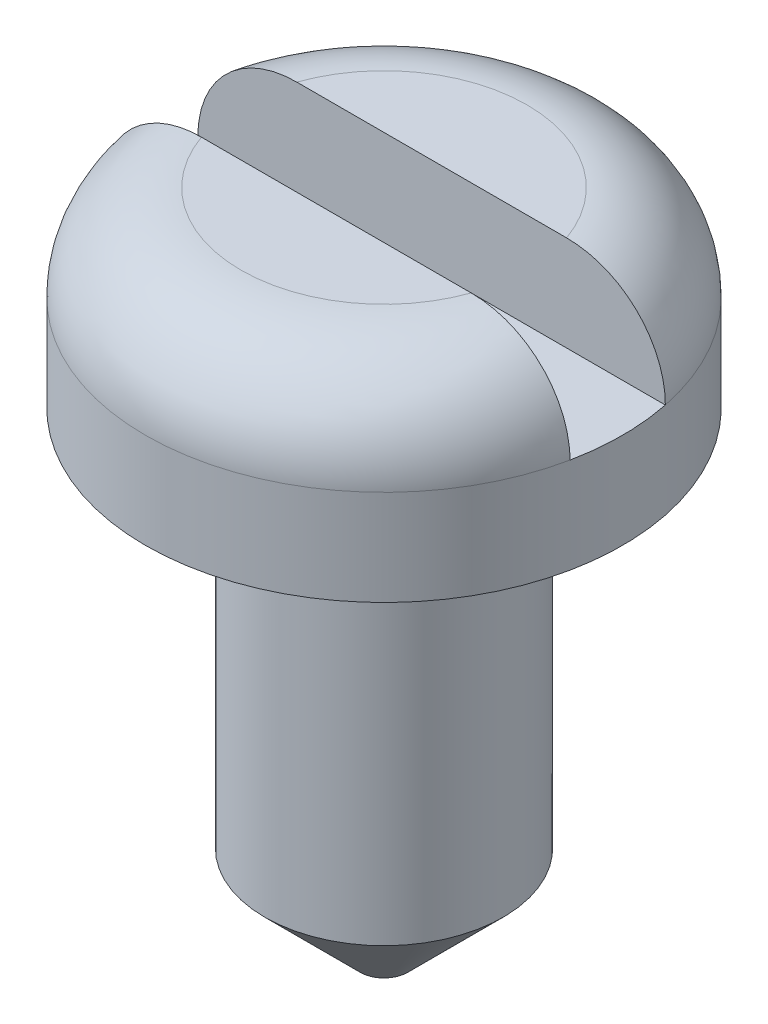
ISO-10303-21;
HEADER;
FILE_DESCRIPTION(('STEP AP214'),'2;1');
FILE_NAME('part.step','',(''),(''),'','','');
FILE_SCHEMA(('AUTOMOTIVE_DESIGN { 1 0 10303 214 1 1 1 1 }'));
ENDSEC;
DATA;
#1=APPLICATION_CONTEXT('core data for automotive mechanical design processes');
#2=APPLICATION_PROTOCOL_DEFINITION('international standard','automotive_design',2000,#1);
#3=PRODUCT_CONTEXT('',#1,'mechanical');
#4=PRODUCT('Part','Part','',(#3));
#5=PRODUCT_RELATED_PRODUCT_CATEGORY('part','',(#4));
#6=PRODUCT_DEFINITION_FORMATION('','',#4);
#7=PRODUCT_DEFINITION_CONTEXT('part definition',#1,'design');
#8=PRODUCT_DEFINITION('design','',#6,#7);
#9=PRODUCT_DEFINITION_SHAPE('','',#8);
#10=(LENGTH_UNIT() NAMED_UNIT(*) SI_UNIT(.MILLI.,.METRE.));
#11=(NAMED_UNIT(*) PLANE_ANGLE_UNIT() SI_UNIT($,.RADIAN.));
#12=(NAMED_UNIT(*) SI_UNIT($,.STERADIAN.) SOLID_ANGLE_UNIT());
#13=UNCERTAINTY_MEASURE_WITH_UNIT(LENGTH_MEASURE(1.E-05),#10,'distance_accuracy_value','');
#14=(GEOMETRIC_REPRESENTATION_CONTEXT(3) GLOBAL_UNCERTAINTY_ASSIGNED_CONTEXT((#13)) GLOBAL_UNIT_ASSIGNED_CONTEXT((#10,
#11,#12)) REPRESENTATION_CONTEXT('',''));
#15=CARTESIAN_POINT('',(0.,0.,0.));
#16=DIRECTION('',(0.,0.,1.));
#17=DIRECTION('',(1.,0.,0.));
#18=AXIS2_PLACEMENT_3D('',#15,#16,#17);
#19=CARTESIAN_POINT('',(0.,8.89,0.));
#20=DIRECTION('',(0.,-1.,0.));
#21=DIRECTION('',(0.,0.,-1.));
#22=AXIS2_PLACEMENT_3D('',#19,#20,#21);
#23=CYLINDRICAL_SURFACE('',#22,3.175);
#24=CARTESIAN_POINT('',(0.,6.35,0.));
#25=DIRECTION('',(0.,1.,0.));
#26=DIRECTION('',(0.,0.,1.));
#27=AXIS2_PLACEMENT_3D('',#24,#25,#26);
#28=CIRCLE('',#27,3.175);
#29=CARTESIAN_POINT('',(0.,6.35,3.175));
#30=VERTEX_POINT('',#29);
#31=EDGE_CURVE('E107',#30,#30,#28,.T.);
#32=ORIENTED_EDGE('',*,*,#31,.T.);
#33=EDGE_LOOP('',(#32));
#34=FACE_BOUND('',#33,.T.);
#35=CARTESIAN_POINT('',(0.,7.62,0.));
#36=DIRECTION('',(0.,1.,0.));
#37=DIRECTION('',(0.,0.,1.));
#38=AXIS2_PLACEMENT_3D('',#35,#36,#37);
#39=CIRCLE('',#38,3.175);
#40=CARTESIAN_POINT('',(-3.11085197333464,7.62,-0.635));
#41=VERTEX_POINT('',#40);
#42=CARTESIAN_POINT('',(-3.11085197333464,7.62,0.635));
#43=VERTEX_POINT('',#42);
#44=EDGE_CURVE('E105',#41,#43,#39,.T.);
#45=ORIENTED_EDGE('',*,*,#44,.F.);
#46=CARTESIAN_POINT('',(0.,7.62,0.));
#47=DIRECTION('',(0.,1.,0.));
#48=DIRECTION('',(0.,0.,1.));
#49=AXIS2_PLACEMENT_3D('',#46,#47,#48);
#50=CIRCLE('',#49,3.175);
#51=CARTESIAN_POINT('',(3.11085197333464,7.62,-0.635));
#52=VERTEX_POINT('',#51);
#53=EDGE_CURVE('E113',#41,#52,#50,.F.);
#54=ORIENTED_EDGE('',*,*,#53,.T.);
#55=CARTESIAN_POINT('',(3.11085197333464,7.62,0.635));
#56=VERTEX_POINT('',#55);
#57=EDGE_CURVE('E102',#56,#52,#39,.T.);
#58=ORIENTED_EDGE('',*,*,#57,.F.);
#59=CARTESIAN_POINT('',(0.,7.62,0.));
#60=DIRECTION('',(0.,1.,0.));
#61=DIRECTION('',(0.,0.,1.));
#62=AXIS2_PLACEMENT_3D('',#59,#60,#61);
#63=CIRCLE('',#62,3.175);
#64=EDGE_CURVE('E111',#56,#43,#63,.F.);
#65=ORIENTED_EDGE('',*,*,#64,.T.);
#66=EDGE_LOOP('',(#45,#54,#58,#65));
#67=FACE_BOUND('',#66,.T.);
#68=ADVANCED_FACE('F47',(#34,#67),#23,.T.);
#69=CARTESIAN_POINT('',(0.,8.89,0.));
#70=DIRECTION('',(0.,1.,0.));
#71=DIRECTION('',(0.,0.,1.));
#72=AXIS2_PLACEMENT_3D('',#69,#70,#71);
#73=PLANE('',#72);
#74=DIRECTION('',(1.,0.,0.));
#75=VECTOR('',#74,1.);
#76=CARTESIAN_POINT('',(0.,8.89,-0.635));
#77=LINE('',#76,#75);
#78=CARTESIAN_POINT('',(-1.79605122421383,8.89,-0.635));
#79=VERTEX_POINT('',#78);
#80=CARTESIAN_POINT('',(1.79605122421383,8.89,-0.635));
#81=VERTEX_POINT('',#80);
#82=EDGE_CURVE('E205',#79,#81,#77,.T.);
#83=ORIENTED_EDGE('',*,*,#82,.T.);
#84=CARTESIAN_POINT('',(0.,8.89,0.));
#85=DIRECTION('',(0.,1.,0.));
#86=DIRECTION('',(0.,0.,1.));
#87=AXIS2_PLACEMENT_3D('',#84,#85,#86);
#88=CIRCLE('',#87,1.905);
#89=EDGE_CURVE('E115',#81,#79,#88,.T.);
#90=ORIENTED_EDGE('',*,*,#89,.T.);
#91=EDGE_LOOP('',(#83,#90));
#92=FACE_BOUND('',#91,.T.);
#93=ADVANCED_FACE('F171',(#92),#73,.T.);
#94=DIRECTION('',(-1.,0.,0.));
#95=VECTOR('',#94,1.);
#96=CARTESIAN_POINT('',(0.,8.89,0.635));
#97=LINE('',#96,#95);
#98=CARTESIAN_POINT('',(1.79605122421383,8.89,0.635));
#99=VERTEX_POINT('',#98);
#100=CARTESIAN_POINT('',(-1.79605122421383,8.89,0.635));
#101=VERTEX_POINT('',#100);
#102=EDGE_CURVE('E93',#99,#101,#97,.T.);
#103=ORIENTED_EDGE('',*,*,#102,.T.);
#104=CARTESIAN_POINT('',(0.,8.89,0.));
#105=DIRECTION('',(0.,1.,0.));
#106=DIRECTION('',(0.,0.,1.));
#107=AXIS2_PLACEMENT_3D('',#104,#105,#106);
#108=CIRCLE('',#107,1.905);
#109=EDGE_CURVE('E123',#101,#99,#108,.T.);
#110=ORIENTED_EDGE('',*,*,#109,.T.);
#111=EDGE_LOOP('',(#103,#110));
#112=FACE_BOUND('',#111,.T.);
#113=ADVANCED_FACE('F175',(#112),#73,.T.);
#114=CARTESIAN_POINT('',(0.,6.35,0.));
#115=DIRECTION('',(0.,-1.,0.));
#116=DIRECTION('',(0.,0.,-1.));
#117=AXIS2_PLACEMENT_3D('',#114,#115,#116);
#118=CYLINDRICAL_SURFACE('',#117,1.5875);
#119=CARTESIAN_POINT('',(0.,1.27,0.));
#120=DIRECTION('',(0.,1.,0.));
#121=DIRECTION('',(0.,0.,1.));
#122=AXIS2_PLACEMENT_3D('',#119,#120,#121);
#123=CIRCLE('',#122,1.5875);
#124=CARTESIAN_POINT('',(0.,1.27,1.5875));
#125=VERTEX_POINT('',#124);
#126=EDGE_CURVE('E57',#125,#125,#123,.T.);
#127=ORIENTED_EDGE('',*,*,#126,.T.);
#128=EDGE_LOOP('',(#127));
#129=FACE_BOUND('',#128,.T.);
#130=CARTESIAN_POINT('',(0.,6.35,0.));
#131=DIRECTION('',(0.,1.,0.));
#132=DIRECTION('',(0.,0.,1.));
#133=AXIS2_PLACEMENT_3D('',#130,#131,#132);
#134=CIRCLE('',#133,1.5875);
#135=CARTESIAN_POINT('',(0.,6.35,1.5875));
#136=VERTEX_POINT('',#135);
#137=EDGE_CURVE('E200',#136,#136,#134,.T.);
#138=ORIENTED_EDGE('',*,*,#137,.F.);
#139=EDGE_LOOP('',(#138));
#140=FACE_BOUND('',#139,.T.);
#141=ADVANCED_FACE('F157',(#129,#140),#118,.T.);
#142=CARTESIAN_POINT('',(0.,0.,0.));
#143=DIRECTION('',(0.,1.,0.));
#144=DIRECTION('',(0.,0.,1.));
#145=AXIS2_PLACEMENT_3D('',#142,#143,#144);
#146=PLANE('',#145);
#147=CARTESIAN_POINT('',(0.,0.,0.));
#148=DIRECTION('',(0.,1.,0.));
#149=DIRECTION('',(0.,0.,1.));
#150=AXIS2_PLACEMENT_3D('',#147,#148,#149);
#151=CIRCLE('',#150,0.317499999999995);
#152=CARTESIAN_POINT('',(0.,0.,0.317499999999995));
#153=VERTEX_POINT('',#152);
#154=EDGE_CURVE('E11',#153,#153,#151,.F.);
#155=ORIENTED_EDGE('',*,*,#154,.T.);
#156=EDGE_LOOP('',(#155));
#157=FACE_BOUND('',#156,.T.);
#158=ADVANCED_FACE('F180',(#157),#146,.F.);
#159=CARTESIAN_POINT('',(0.,6.35,0.));
#160=DIRECTION('',(0.,1.,0.));
#161=DIRECTION('',(0.,0.,1.));
#162=AXIS2_PLACEMENT_3D('',#159,#160,#161);
#163=PLANE('',#162);
#164=ORIENTED_EDGE('',*,*,#137,.T.);
#165=EDGE_LOOP('',(#164));
#166=FACE_BOUND('',#165,.T.);
#167=ORIENTED_EDGE('',*,*,#31,.F.);
#168=EDGE_LOOP('',(#167));
#169=FACE_BOUND('',#168,.T.);
#170=ADVANCED_FACE('F177',(#166,#169),#163,.F.);
#171=CARTESIAN_POINT('',(6.096,7.62,0.635));
#172=DIRECTION('',(0.,1.,0.));
#173=DIRECTION('',(0.,0.,1.));
#174=AXIS2_PLACEMENT_3D('',#171,#172,#173);
#175=PLANE('',#174);
#176=ORIENTED_EDGE('',*,*,#57,.T.);
#177=DIRECTION('',(-1.,0.,0.));
#178=VECTOR('',#177,1.);
#179=CARTESIAN_POINT('',(6.096,7.62,-0.635));
#180=LINE('',#179,#178);
#181=EDGE_CURVE('E108',#52,#41,#180,.T.);
#182=ORIENTED_EDGE('',*,*,#181,.T.);
#183=ORIENTED_EDGE('',*,*,#44,.T.);
#184=DIRECTION('',(-1.,0.,0.));
#185=VECTOR('',#184,1.);
#186=CARTESIAN_POINT('',(6.096,7.62,0.635));
#187=LINE('',#186,#185);
#188=EDGE_CURVE('E92',#56,#43,#187,.T.);
#189=ORIENTED_EDGE('',*,*,#188,.F.);
#190=EDGE_LOOP('',(#176,#182,#183,#189));
#191=FACE_BOUND('',#190,.T.);
#192=ADVANCED_FACE('F100',(#191),#175,.T.);
#193=CARTESIAN_POINT('',(6.096,10.16,-0.635));
#194=DIRECTION('',(0.,0.,1.));
#195=DIRECTION('',(0.,-1.,0.));
#196=AXIS2_PLACEMENT_3D('',#193,#194,#195);
#197=PLANE('',#196);
#198=ORIENTED_EDGE('',*,*,#82,.F.);
#199=CARTESIAN_POINT('',(-1.79605122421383,8.89,-0.635));
#200=CARTESIAN_POINT('',(-1.83654878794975,8.89000022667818,-0.635));
#201=CARTESIAN_POINT('',(-1.87702942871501,8.88827640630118,-0.635));
#202=CARTESIAN_POINT('',(-1.95770228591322,8.88132849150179,-0.635));
#203=CARTESIAN_POINT('',(-1.99789439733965,8.87610318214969,-0.635));
#204=CARTESIAN_POINT('',(-2.11759219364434,8.85510220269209,-0.635));
#205=CARTESIAN_POINT('',(-2.19624124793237,8.83400153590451,-0.635));
#206=CARTESIAN_POINT('',(-2.34507483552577,8.77909394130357,-0.635));
#207=CARTESIAN_POINT('',(-2.41547827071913,8.74587541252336,-0.635));
#208=CARTESIAN_POINT('',(-2.54922147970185,8.66749173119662,-0.635));
#209=CARTESIAN_POINT('',(-2.61256921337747,8.62234023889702,-0.635));
#210=CARTESIAN_POINT('',(-2.72703760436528,8.52397779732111,-0.635));
#211=CARTESIAN_POINT('',(-2.77862135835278,8.47130483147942,-0.635));
#212=CARTESIAN_POINT('',(-2.87192062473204,8.35779548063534,-0.635));
#213=CARTESIAN_POINT('',(-2.91363305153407,8.2969565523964,-0.635));
#214=CARTESIAN_POINT('',(-2.98477200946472,8.17076409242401,-0.635));
#215=CARTESIAN_POINT('',(-3.01451362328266,8.10558769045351,-0.635));
#216=CARTESIAN_POINT('',(-3.06241949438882,7.97115176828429,-0.635));
#217=CARTESIAN_POINT('',(-3.08059722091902,7.90189710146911,-0.635));
#218=CARTESIAN_POINT('',(-3.09875720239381,7.79669545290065,-0.635));
#219=CARTESIAN_POINT('',(-3.10329272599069,7.76147932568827,-0.635));
#220=CARTESIAN_POINT('',(-3.10933751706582,7.69084771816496,-0.635));
#221=CARTESIAN_POINT('',(-3.110851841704,7.6554326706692,-0.635));
#222=CARTESIAN_POINT('',(-3.11085197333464,7.62,-0.635));
#223=B_SPLINE_CURVE_WITH_KNOTS('',3,(#199,#200,#201,#202,#203,#204,#205,#206,#207,#208,#209,
#210,#211,#212,#213,#214,#215,#216,#217,#218,#219,#220,#221,#222),.UNSPECIFIED.,.F.,.F.,(4,2,2,
2,2,2,2,2,2,2,2,4),(0.,0.121418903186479,0.242879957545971,0.485737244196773,0.718101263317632,
0.950200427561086,1.17028867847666,1.39044563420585,1.60435442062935,1.81801359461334,
1.92442259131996,2.03065332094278),.UNSPECIFIED.);
#224=EDGE_CURVE('E119',#79,#41,#223,.T.);
#225=ORIENTED_EDGE('',*,*,#224,.T.);
#226=ORIENTED_EDGE('',*,*,#181,.F.);
#227=CARTESIAN_POINT('',(3.11085197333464,7.62,-0.635));
#228=CARTESIAN_POINT('',(3.11085196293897,7.65513943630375,-0.635));
#229=CARTESIAN_POINT('',(3.10936254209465,7.69026192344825,-0.635));
#230=CARTESIAN_POINT('',(3.10342219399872,7.76025294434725,-0.635));
#231=CARTESIAN_POINT('',(3.0989714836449,7.79512149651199,-0.635));
#232=CARTESIAN_POINT('',(3.08122762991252,7.89888026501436,-0.635));
#233=CARTESIAN_POINT('',(3.06354259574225,7.96707117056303,-0.635));
#234=CARTESIAN_POINT('',(3.01698785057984,8.09950659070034,-0.635));
#235=CARTESIAN_POINT('',(2.98811418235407,8.16374969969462,-0.635));
#236=CARTESIAN_POINT('',(2.92005438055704,8.28652060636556,-0.635));
#237=CARTESIAN_POINT('',(2.88086867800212,8.34504864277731,-0.635));
#238=CARTESIAN_POINT('',(2.79308114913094,8.45514420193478,-0.635));
#239=CARTESIAN_POINT('',(2.74442250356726,8.50666636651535,-0.635));
#240=CARTESIAN_POINT('',(2.63928426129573,8.60098701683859,-0.635));
#241=CARTESIAN_POINT('',(2.58280416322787,8.64378494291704,-0.635));
#242=CARTESIAN_POINT('',(2.46254437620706,8.7203368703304,-0.635));
#243=CARTESIAN_POINT('',(2.39864867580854,8.75390830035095,-0.635));
#244=CARTESIAN_POINT('',(2.26624085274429,8.81023425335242,-0.635));
#245=CARTESIAN_POINT('',(2.19772783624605,8.83298667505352,-0.635));
#246=CARTESIAN_POINT('',(2.0735925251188,8.86350622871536,-0.635));
#247=CARTESIAN_POINT('',(2.01849850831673,8.87348247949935,-0.635));
#248=CARTESIAN_POINT('',(1.90761800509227,8.88673224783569,-0.635));
#249=CARTESIAN_POINT('',(1.85183310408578,8.89001898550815,-0.635));
#250=CARTESIAN_POINT('',(1.79605122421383,8.89,-0.635));
#251=B_SPLINE_CURVE_WITH_KNOTS('',3,(#227,#228,#229,#230,#231,#232,#233,#234,#235,#236,#237,
#238,#239,#240,#241,#242,#243,#244,#245,#246,#247,#248,#249,#250),.UNSPECIFIED.,.F.,.F.,(4,2,2,
2,2,2,2,2,2,2,2,4),(0.,0.105353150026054,0.210698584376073,0.42095239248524,0.631280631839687,
0.841600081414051,1.05322222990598,1.26485794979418,1.48042109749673,1.69602609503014,
1.86360217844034,2.03084676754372),.UNSPECIFIED.);
#252=EDGE_CURVE('E125',#52,#81,#251,.T.);
#253=ORIENTED_EDGE('',*,*,#252,.T.);
#254=EDGE_LOOP('',(#198,#225,#226,#253));
#255=FACE_BOUND('',#254,.T.);
#256=ADVANCED_FACE('F166',(#255),#197,.T.);
#257=CARTESIAN_POINT('',(6.096,10.16,0.635));
#258=DIRECTION('',(0.,0.,-1.));
#259=DIRECTION('',(0.,1.,0.));
#260=AXIS2_PLACEMENT_3D('',#257,#258,#259);
#261=PLANE('',#260);
#262=ORIENTED_EDGE('',*,*,#102,.F.);
#263=CARTESIAN_POINT('',(1.79605122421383,8.89,0.635));
#264=CARTESIAN_POINT('',(1.83654878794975,8.89000022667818,0.635));
#265=CARTESIAN_POINT('',(1.87702942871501,8.88827640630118,0.635));
#266=CARTESIAN_POINT('',(1.95770228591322,8.88132849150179,0.635));
#267=CARTESIAN_POINT('',(1.99789439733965,8.87610318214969,0.635));
#268=CARTESIAN_POINT('',(2.11759219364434,8.85510220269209,0.635));
#269=CARTESIAN_POINT('',(2.19624124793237,8.83400153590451,0.635));
#270=CARTESIAN_POINT('',(2.34507483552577,8.77909394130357,0.635));
#271=CARTESIAN_POINT('',(2.41547827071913,8.74587541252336,0.635));
#272=CARTESIAN_POINT('',(2.54922147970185,8.66749173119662,0.635));
#273=CARTESIAN_POINT('',(2.61256921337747,8.62234023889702,0.635));
#274=CARTESIAN_POINT('',(2.72703760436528,8.52397779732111,0.635));
#275=CARTESIAN_POINT('',(2.77862135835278,8.47130483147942,0.635));
#276=CARTESIAN_POINT('',(2.87192062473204,8.35779548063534,0.635));
#277=CARTESIAN_POINT('',(2.91363305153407,8.2969565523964,0.635));
#278=CARTESIAN_POINT('',(2.98477200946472,8.17076409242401,0.635));
#279=CARTESIAN_POINT('',(3.01451362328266,8.10558769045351,0.635));
#280=CARTESIAN_POINT('',(3.06241949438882,7.97115176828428,0.635));
#281=CARTESIAN_POINT('',(3.08059722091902,7.90189710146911,0.635));
#282=CARTESIAN_POINT('',(3.09875720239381,7.79669545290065,0.635));
#283=CARTESIAN_POINT('',(3.10329272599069,7.76147932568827,0.635));
#284=CARTESIAN_POINT('',(3.10933751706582,7.69084771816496,0.635));
#285=CARTESIAN_POINT('',(3.110851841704,7.6554326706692,0.635));
#286=CARTESIAN_POINT('',(3.11085197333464,7.62,0.635));
#287=B_SPLINE_CURVE_WITH_KNOTS('',3,(#263,#264,#265,#266,#267,#268,#269,#270,#271,#272,#273,
#274,#275,#276,#277,#278,#279,#280,#281,#282,#283,#284,#285,#286),.UNSPECIFIED.,.F.,.F.,(4,2,2,
2,2,2,2,2,2,2,2,4),(0.,0.121418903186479,0.242879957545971,0.485737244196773,0.718101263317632,
0.950200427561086,1.17028867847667,1.39044563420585,1.60435442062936,1.81801359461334,
1.92442259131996,2.03065332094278),.UNSPECIFIED.);
#288=EDGE_CURVE('E72',#99,#56,#287,.T.);
#289=ORIENTED_EDGE('',*,*,#288,.T.);
#290=ORIENTED_EDGE('',*,*,#188,.T.);
#291=CARTESIAN_POINT('',(-3.11085197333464,7.62,0.635));
#292=CARTESIAN_POINT('',(-3.11085196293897,7.65513943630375,0.635));
#293=CARTESIAN_POINT('',(-3.10936254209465,7.69026192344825,0.635));
#294=CARTESIAN_POINT('',(-3.10342219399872,7.76025294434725,0.635));
#295=CARTESIAN_POINT('',(-3.0989714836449,7.79512149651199,0.635));
#296=CARTESIAN_POINT('',(-3.08122762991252,7.89888026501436,0.635));
#297=CARTESIAN_POINT('',(-3.06354259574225,7.96707117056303,0.635));
#298=CARTESIAN_POINT('',(-3.01698785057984,8.09950659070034,0.635));
#299=CARTESIAN_POINT('',(-2.98811418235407,8.16374969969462,0.635));
#300=CARTESIAN_POINT('',(-2.92005438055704,8.28652060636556,0.635));
#301=CARTESIAN_POINT('',(-2.88086867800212,8.34504864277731,0.635));
#302=CARTESIAN_POINT('',(-2.79308114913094,8.45514420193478,0.635));
#303=CARTESIAN_POINT('',(-2.74442250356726,8.50666636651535,0.635));
#304=CARTESIAN_POINT('',(-2.63928426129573,8.60098701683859,0.635));
#305=CARTESIAN_POINT('',(-2.58280416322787,8.64378494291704,0.635));
#306=CARTESIAN_POINT('',(-2.46254437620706,8.7203368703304,0.635));
#307=CARTESIAN_POINT('',(-2.39864867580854,8.75390830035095,0.635));
#308=CARTESIAN_POINT('',(-2.26624085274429,8.81023425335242,0.635));
#309=CARTESIAN_POINT('',(-2.19772783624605,8.83298667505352,0.635));
#310=CARTESIAN_POINT('',(-2.0735925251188,8.86350622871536,0.635));
#311=CARTESIAN_POINT('',(-2.01849850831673,8.87348247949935,0.635));
#312=CARTESIAN_POINT('',(-1.90761800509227,8.88673224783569,0.635));
#313=CARTESIAN_POINT('',(-1.85183310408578,8.89001898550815,0.635));
#314=CARTESIAN_POINT('',(-1.79605122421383,8.89,0.635));
#315=B_SPLINE_CURVE_WITH_KNOTS('',3,(#291,#292,#293,#294,#295,#296,#297,#298,#299,#300,#301,
#302,#303,#304,#305,#306,#307,#308,#309,#310,#311,#312,#313,#314),.UNSPECIFIED.,.F.,.F.,(4,2,2,
2,2,2,2,2,2,2,2,4),(0.,0.105353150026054,0.210698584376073,0.42095239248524,0.631280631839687,
0.841600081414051,1.05322222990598,1.26485794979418,1.48042109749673,1.69602609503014,
1.86360217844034,2.03084676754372),.UNSPECIFIED.);
#316=EDGE_CURVE('E64',#43,#101,#315,.T.);
#317=ORIENTED_EDGE('',*,*,#316,.T.);
#318=EDGE_LOOP('',(#262,#289,#290,#317));
#319=FACE_BOUND('',#318,.T.);
#320=ADVANCED_FACE('F91',(#319),#261,.T.);
#321=CARTESIAN_POINT('',(0.,7.62,0.));
#322=DIRECTION('',(0.,1.,0.));
#323=DIRECTION('',(0.,0.,1.));
#324=AXIS2_PLACEMENT_3D('',#321,#322,#323);
#325=TOROIDAL_SURFACE('',#324,1.905,1.27);
#326=ORIENTED_EDGE('',*,*,#252,.F.);
#327=ORIENTED_EDGE('',*,*,#53,.F.);
#328=ORIENTED_EDGE('',*,*,#224,.F.);
#329=ORIENTED_EDGE('',*,*,#89,.F.);
#330=EDGE_LOOP('',(#326,#327,#328,#329));
#331=FACE_BOUND('',#330,.T.);
#332=ADVANCED_FACE('F151',(#331),#325,.T.);
#333=CARTESIAN_POINT('',(0.,7.62,0.));
#334=DIRECTION('',(0.,1.,0.));
#335=DIRECTION('',(0.,0.,1.));
#336=AXIS2_PLACEMENT_3D('',#333,#334,#335);
#337=TOROIDAL_SURFACE('',#336,1.905,1.27);
#338=ORIENTED_EDGE('',*,*,#316,.F.);
#339=ORIENTED_EDGE('',*,*,#64,.F.);
#340=ORIENTED_EDGE('',*,*,#288,.F.);
#341=ORIENTED_EDGE('',*,*,#109,.F.);
#342=EDGE_LOOP('',(#338,#339,#340,#341));
#343=FACE_BOUND('',#342,.T.);
#344=ADVANCED_FACE('F117',(#343),#337,.T.);
#345=CARTESIAN_POINT('',(0.,1.27,0.));
#346=DIRECTION('',(0.,1.,0.));
#347=DIRECTION('',(0.,0.,1.));
#348=AXIS2_PLACEMENT_3D('',#345,#346,#347);
#349=CONICAL_SURFACE('',#348,1.5875,0.78539816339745);
#350=CARTESIAN_POINT('',(0.,0.,0.317499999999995));
#351=CARTESIAN_POINT('',(0.,0.0132291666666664,0.330729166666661));
#352=CARTESIAN_POINT('',(0.,0.0264583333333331,0.343958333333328));
#353=CARTESIAN_POINT('',(0.,0.0529166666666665,0.370416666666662));
#354=CARTESIAN_POINT('',(0.,0.0661458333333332,0.383645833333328));
#355=CARTESIAN_POINT('',(0.,0.0926041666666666,0.410104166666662));
#356=CARTESIAN_POINT('',(0.,0.105833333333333,0.423333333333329));
#357=CARTESIAN_POINT('',(0.,0.132291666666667,0.449791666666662));
#358=CARTESIAN_POINT('',(0.,0.145520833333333,0.463020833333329));
#359=CARTESIAN_POINT('',(0.,0.171979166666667,0.489479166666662));
#360=CARTESIAN_POINT('',(0.,0.185208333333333,0.502708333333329));
#361=CARTESIAN_POINT('',(0.,0.211666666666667,0.529166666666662));
#362=CARTESIAN_POINT('',(0.,0.224895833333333,0.542395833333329));
#363=CARTESIAN_POINT('',(0.,0.251354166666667,0.568854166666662));
#364=CARTESIAN_POINT('',(0.,0.264583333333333,0.582083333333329));
#365=CARTESIAN_POINT('',(0.,0.291041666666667,0.608541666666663));
#366=CARTESIAN_POINT('',(0.,0.304270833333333,0.621770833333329));
#367=CARTESIAN_POINT('',(0.,0.330729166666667,0.648229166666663));
#368=CARTESIAN_POINT('',(0.,0.343958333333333,0.661458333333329));
#369=CARTESIAN_POINT('',(0.,0.370416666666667,0.687916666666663));
#370=CARTESIAN_POINT('',(0.,0.383645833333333,0.70114583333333));
#371=CARTESIAN_POINT('',(0.,0.410104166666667,0.727604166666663));
#372=CARTESIAN_POINT('',(0.,0.423333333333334,0.74083333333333));
#373=CARTESIAN_POINT('',(0.,0.449791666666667,0.767291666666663));
#374=CARTESIAN_POINT('',(0.,0.463020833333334,0.78052083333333));
#375=CARTESIAN_POINT('',(0.,0.489479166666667,0.806979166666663));
#376=CARTESIAN_POINT('',(0.,0.502708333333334,0.82020833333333));
#377=CARTESIAN_POINT('',(0.,0.529166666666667,0.846666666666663));
#378=CARTESIAN_POINT('',(0.,0.542395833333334,0.85989583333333));
#379=CARTESIAN_POINT('',(0.,0.568854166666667,0.886354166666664));
#380=CARTESIAN_POINT('',(0.,0.582083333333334,0.89958333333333));
#381=CARTESIAN_POINT('',(0.,0.608541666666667,0.926041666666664));
#382=CARTESIAN_POINT('',(0.,0.621770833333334,0.939270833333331));
#383=CARTESIAN_POINT('',(0.,0.648229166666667,0.965729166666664));
#384=CARTESIAN_POINT('',(0.,0.661458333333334,0.978958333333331));
#385=CARTESIAN_POINT('',(0.,0.687916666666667,1.00541666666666));
#386=CARTESIAN_POINT('',(0.,0.701145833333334,1.01864583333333));
#387=CARTESIAN_POINT('',(0.,0.727604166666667,1.04510416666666));
#388=CARTESIAN_POINT('',(0.,0.740833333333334,1.05833333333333));
#389=CARTESIAN_POINT('',(0.,0.767291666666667,1.08479166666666));
#390=CARTESIAN_POINT('',(0.,0.780520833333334,1.09802083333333));
#391=CARTESIAN_POINT('',(0.,0.806979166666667,1.12447916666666));
#392=CARTESIAN_POINT('',(0.,0.820208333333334,1.13770833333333));
#393=CARTESIAN_POINT('',(0.,0.846666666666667,1.16416666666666));
#394=CARTESIAN_POINT('',(0.,0.859895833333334,1.17739583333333));
#395=CARTESIAN_POINT('',(0.,0.886354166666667,1.20385416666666));
#396=CARTESIAN_POINT('',(0.,0.899583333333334,1.21708333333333));
#397=CARTESIAN_POINT('',(0.,0.926041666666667,1.24354166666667));
#398=CARTESIAN_POINT('',(0.,0.939270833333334,1.25677083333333));
#399=CARTESIAN_POINT('',(0.,0.965729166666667,1.28322916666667));
#400=CARTESIAN_POINT('',(0.,0.978958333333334,1.29645833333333));
#401=CARTESIAN_POINT('',(0.,1.00541666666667,1.32291666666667));
#402=CARTESIAN_POINT('',(0.,1.01864583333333,1.33614583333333));
#403=CARTESIAN_POINT('',(0.,1.04510416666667,1.36260416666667));
#404=CARTESIAN_POINT('',(0.,1.05833333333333,1.37583333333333));
#405=CARTESIAN_POINT('',(0.,1.08479166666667,1.40229166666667));
#406=CARTESIAN_POINT('',(0.,1.09802083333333,1.41552083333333));
#407=CARTESIAN_POINT('',(0.,1.12447916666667,1.44197916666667));
#408=CARTESIAN_POINT('',(0.,1.13770833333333,1.45520833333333));
#409=CARTESIAN_POINT('',(0.,1.16416666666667,1.48166666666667));
#410=CARTESIAN_POINT('',(0.,1.17739583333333,1.49489583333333));
#411=CARTESIAN_POINT('',(0.,1.20385416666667,1.52135416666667));
#412=CARTESIAN_POINT('',(0.,1.21708333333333,1.53458333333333));
#413=CARTESIAN_POINT('',(0.,1.24354166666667,1.56104166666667));
#414=CARTESIAN_POINT('',(0.,1.25677083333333,1.57427083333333));
#415=CARTESIAN_POINT('',(0.,1.27,1.5875));
#416=B_SPLINE_CURVE_WITH_KNOTS('',3,(#350,#351,#352,#353,#354,#355,#356,#357,#358,#359,#360,
#361,#362,#363,#364,#365,#366,#367,#368,#369,#370,#371,#372,#373,#374,#375,#376,#377,#378,#379,
#380,#381,#382,#383,#384,#385,#386,#387,#388,#389,#390,#391,#392,#393,#394,#395,#396,#397,#398,
#399,#400,#401,#402,#403,#404,#405,#406,#407,#408,#409,#410,#411,#412,#413,#414,#415),
.UNSPECIFIED.,.F.,.F.,(4,2,2,2,2,2,2,2,2,2,2,2,2,2,2,2,2,2,2,2,2,2,2,2,2,2,2,2,2,2,2,2,4),(0.,
0.0561266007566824,0.112253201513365,0.168379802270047,0.22450640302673,0.280633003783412,
0.336759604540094,0.392886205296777,0.449012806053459,0.505139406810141,0.561266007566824,
0.617392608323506,0.673519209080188,0.729645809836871,0.785772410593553,0.841899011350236,
0.898025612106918,0.9541522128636,1.01027881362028,1.06640541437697,1.12253201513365,
1.17865861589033,1.23478521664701,1.29091181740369,1.34703841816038,1.40316501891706,
1.45929161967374,1.51541822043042,1.57154482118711,1.62767142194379,1.68379802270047,
1.73992462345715,1.79605122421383),.UNSPECIFIED.);
#417=EDGE_CURVE('BSEAM50',#153,#125,#416,.T.);
#418=ORIENTED_EDGE('',*,*,#154,.F.);
#419=ORIENTED_EDGE('',*,*,#126,.F.);
#420=ORIENTED_EDGE('',*,*,#417,.T.);
#421=ORIENTED_EDGE('',*,*,#417,.F.);
#422=EDGE_LOOP('',(#418,#420,#419,#421));
#423=FACE_BOUND('',#422,.T.);
#424=ADVANCED_FACE('F50',(#423),#349,.T.);
#425=CLOSED_SHELL('',(#68,#93,#113,#141,#158,#170,#192,#256,#320,#332,#344,#424));
#426=MANIFOLD_SOLID_BREP('B2',#425);
#427=ADVANCED_BREP_SHAPE_REPRESENTATION('',(#18,#426),#14);
#428=SHAPE_DEFINITION_REPRESENTATION(#9,#427);
ENDSEC;
END-ISO-10303-21;
